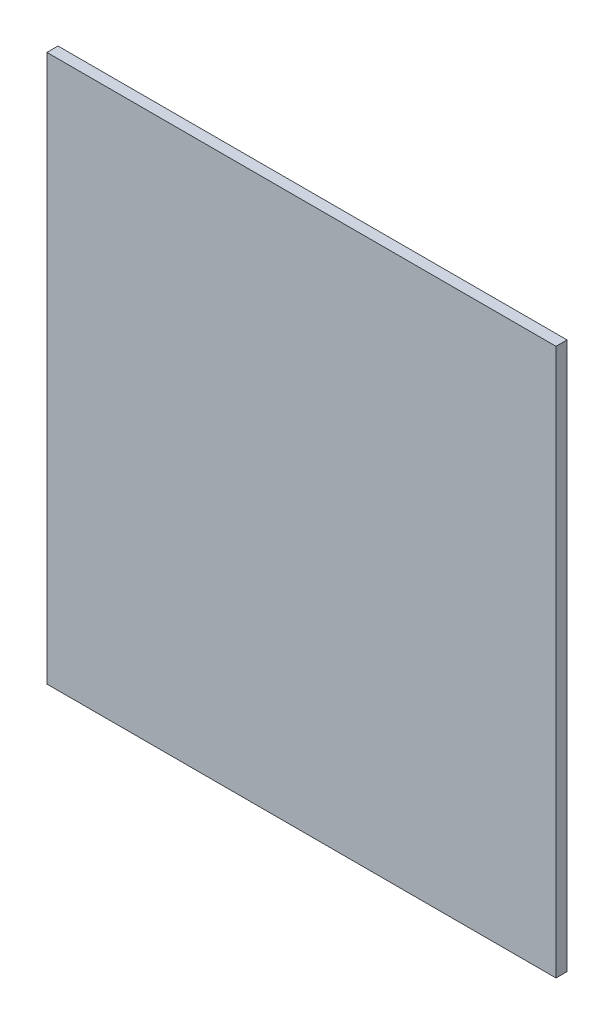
from build123d import *

# Parameters (mm, degrees)
SKETCH1_W           = 460
SKETCH1_H           = 494.325880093
BOSS_EXTRUDE1_DEPTH = 10


with BuildPart() as part:
    # Sketch1 → Boss-Extrude1 (new body)
    with BuildSketch(Plane.XY):
        with Locations((503.224185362, -106.047034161)):
            Rectangle(SKETCH1_W, SKETCH1_H)
    extrude(amount=BOSS_EXTRUDE1_DEPTH)


solid = part.part
